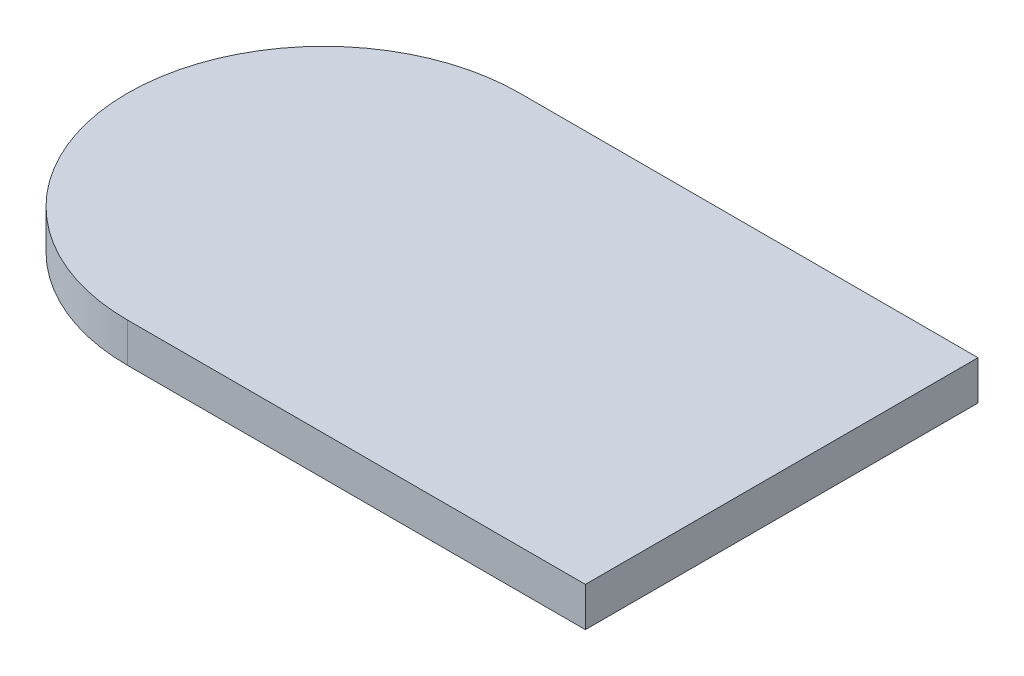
ISO-10303-21;
HEADER;
FILE_DESCRIPTION(('STEP AP214'),'2;1');
FILE_NAME('part.step','',(''),(''),'','','');
FILE_SCHEMA(('AUTOMOTIVE_DESIGN { 1 0 10303 214 1 1 1 1 }'));
ENDSEC;
DATA;
#1=APPLICATION_CONTEXT('core data for automotive mechanical design processes');
#2=APPLICATION_PROTOCOL_DEFINITION('international standard','automotive_design',2000,#1);
#3=PRODUCT_CONTEXT('',#1,'mechanical');
#4=PRODUCT('Part','Part','',(#3));
#5=PRODUCT_RELATED_PRODUCT_CATEGORY('part','',(#4));
#6=PRODUCT_DEFINITION_FORMATION('','',#4);
#7=PRODUCT_DEFINITION_CONTEXT('part definition',#1,'design');
#8=PRODUCT_DEFINITION('design','',#6,#7);
#9=PRODUCT_DEFINITION_SHAPE('','',#8);
#10=(LENGTH_UNIT() NAMED_UNIT(*) SI_UNIT(.MILLI.,.METRE.));
#11=(NAMED_UNIT(*) PLANE_ANGLE_UNIT() SI_UNIT($,.RADIAN.));
#12=(NAMED_UNIT(*) SI_UNIT($,.STERADIAN.) SOLID_ANGLE_UNIT());
#13=UNCERTAINTY_MEASURE_WITH_UNIT(LENGTH_MEASURE(1.E-05),#10,'distance_accuracy_value','');
#14=(GEOMETRIC_REPRESENTATION_CONTEXT(3) GLOBAL_UNCERTAINTY_ASSIGNED_CONTEXT((#13)) GLOBAL_UNIT_ASSIGNED_CONTEXT((#10,
#11,#12)) REPRESENTATION_CONTEXT('',''));
#15=CARTESIAN_POINT('',(0.,0.,0.));
#16=DIRECTION('',(0.,0.,1.));
#17=DIRECTION('',(1.,0.,0.));
#18=AXIS2_PLACEMENT_3D('',#15,#16,#17);
#19=CARTESIAN_POINT('',(0.,0.3,0.));
#20=DIRECTION('',(0.,-1.,0.));
#21=DIRECTION('',(0.,0.,-1.));
#22=AXIS2_PLACEMENT_3D('',#19,#20,#21);
#23=CYLINDRICAL_SURFACE('',#22,1.5);
#24=CARTESIAN_POINT('',(0.,0.,0.));
#25=DIRECTION('',(0.,1.,0.));
#26=DIRECTION('',(0.,0.,1.));
#27=AXIS2_PLACEMENT_3D('',#24,#25,#26);
#28=CIRCLE('',#27,1.5);
#29=CARTESIAN_POINT('',(0.,0.,-1.5));
#30=VERTEX_POINT('',#29);
#31=CARTESIAN_POINT('',(0.,0.,1.5));
#32=VERTEX_POINT('',#31);
#33=EDGE_CURVE('E95',#30,#32,#28,.T.);
#34=ORIENTED_EDGE('',*,*,#33,.T.);
#35=DIRECTION('',(0.,-1.,0.));
#36=VECTOR('',#35,1.);
#37=CARTESIAN_POINT('',(0.,0.3,1.5));
#38=LINE('',#37,#36);
#39=CARTESIAN_POINT('',(0.,0.3,1.5));
#40=VERTEX_POINT('',#39);
#41=EDGE_CURVE('E11',#40,#32,#38,.T.);
#42=ORIENTED_EDGE('',*,*,#41,.F.);
#43=CARTESIAN_POINT('',(0.,0.3,0.));
#44=DIRECTION('',(0.,1.,0.));
#45=DIRECTION('',(0.,0.,1.));
#46=AXIS2_PLACEMENT_3D('',#43,#44,#45);
#47=CIRCLE('',#46,1.5);
#48=CARTESIAN_POINT('',(0.,0.3,-1.5));
#49=VERTEX_POINT('',#48);
#50=EDGE_CURVE('E83',#49,#40,#47,.T.);
#51=ORIENTED_EDGE('',*,*,#50,.F.);
#52=DIRECTION('',(0.,-1.,0.));
#53=VECTOR('',#52,1.);
#54=CARTESIAN_POINT('',(0.,0.3,-1.5));
#55=LINE('',#54,#53);
#56=EDGE_CURVE('E91',#49,#30,#55,.T.);
#57=ORIENTED_EDGE('',*,*,#56,.T.);
#58=EDGE_LOOP('',(#34,#42,#51,#57));
#59=FACE_BOUND('',#58,.T.);
#60=ADVANCED_FACE('F32',(#59),#23,.T.);
#61=CARTESIAN_POINT('',(0.,0.3,1.5));
#62=DIRECTION('',(0.,0.,-1.));
#63=DIRECTION('',(-1.,0.,0.));
#64=AXIS2_PLACEMENT_3D('',#61,#62,#63);
#65=PLANE('',#64);
#66=DIRECTION('',(1.,0.,0.));
#67=VECTOR('',#66,1.);
#68=CARTESIAN_POINT('',(0.,0.,1.5));
#69=LINE('',#68,#67);
#70=CARTESIAN_POINT('',(3.5,0.,1.5));
#71=VERTEX_POINT('',#70);
#72=EDGE_CURVE('E87',#32,#71,#69,.T.);
#73=ORIENTED_EDGE('',*,*,#72,.T.);
#74=DIRECTION('',(0.,-1.,0.));
#75=VECTOR('',#74,1.);
#76=CARTESIAN_POINT('',(3.5,0.3,1.5));
#77=LINE('',#76,#75);
#78=CARTESIAN_POINT('',(3.5,0.3,1.5));
#79=VERTEX_POINT('',#78);
#80=EDGE_CURVE('E40',#79,#71,#77,.T.);
#81=ORIENTED_EDGE('',*,*,#80,.F.);
#82=DIRECTION('',(1.,0.,0.));
#83=VECTOR('',#82,1.);
#84=CARTESIAN_POINT('',(0.,0.3,1.5));
#85=LINE('',#84,#83);
#86=EDGE_CURVE('E78',#40,#79,#85,.T.);
#87=ORIENTED_EDGE('',*,*,#86,.F.);
#88=ORIENTED_EDGE('',*,*,#41,.T.);
#89=EDGE_LOOP('',(#73,#81,#87,#88));
#90=FACE_BOUND('',#89,.T.);
#91=ADVANCED_FACE('F86',(#90),#65,.F.);
#92=CARTESIAN_POINT('',(3.5,0.3,1.5));
#93=DIRECTION('',(-1.,0.,0.));
#94=DIRECTION('',(0.,0.,1.));
#95=AXIS2_PLACEMENT_3D('',#92,#93,#94);
#96=PLANE('',#95);
#97=DIRECTION('',(0.,0.,-1.));
#98=VECTOR('',#97,1.);
#99=CARTESIAN_POINT('',(3.5,0.,1.5));
#100=LINE('',#99,#98);
#101=CARTESIAN_POINT('',(3.5,0.,-1.5));
#102=VERTEX_POINT('',#101);
#103=EDGE_CURVE('E65',#71,#102,#100,.T.);
#104=ORIENTED_EDGE('',*,*,#103,.T.);
#105=DIRECTION('',(0.,-1.,0.));
#106=VECTOR('',#105,1.);
#107=CARTESIAN_POINT('',(3.5,0.3,-1.5));
#108=LINE('',#107,#106);
#109=CARTESIAN_POINT('',(3.5,0.3,-1.5));
#110=VERTEX_POINT('',#109);
#111=EDGE_CURVE('E88',#110,#102,#108,.T.);
#112=ORIENTED_EDGE('',*,*,#111,.F.);
#113=DIRECTION('',(0.,0.,-1.));
#114=VECTOR('',#113,1.);
#115=CARTESIAN_POINT('',(3.5,0.3,1.5));
#116=LINE('',#115,#114);
#117=EDGE_CURVE('E81',#79,#110,#116,.T.);
#118=ORIENTED_EDGE('',*,*,#117,.F.);
#119=ORIENTED_EDGE('',*,*,#80,.T.);
#120=EDGE_LOOP('',(#104,#112,#118,#119));
#121=FACE_BOUND('',#120,.T.);
#122=ADVANCED_FACE('F89',(#121),#96,.F.);
#123=CARTESIAN_POINT('',(0.,0.3,-1.5));
#124=DIRECTION('',(0.,0.,1.));
#125=DIRECTION('',(1.,0.,0.));
#126=AXIS2_PLACEMENT_3D('',#123,#124,#125);
#127=PLANE('',#126);
#128=DIRECTION('',(-1.,0.,0.));
#129=VECTOR('',#128,1.);
#130=CARTESIAN_POINT('',(0.,0.,-1.5));
#131=LINE('',#130,#129);
#132=EDGE_CURVE('E71',#102,#30,#131,.T.);
#133=ORIENTED_EDGE('',*,*,#132,.T.);
#134=ORIENTED_EDGE('',*,*,#56,.F.);
#135=DIRECTION('',(-1.,0.,0.));
#136=VECTOR('',#135,1.);
#137=CARTESIAN_POINT('',(0.,0.3,-1.5));
#138=LINE('',#137,#136);
#139=EDGE_CURVE('E48',#110,#49,#138,.T.);
#140=ORIENTED_EDGE('',*,*,#139,.F.);
#141=ORIENTED_EDGE('',*,*,#111,.T.);
#142=EDGE_LOOP('',(#133,#134,#140,#141));
#143=FACE_BOUND('',#142,.T.);
#144=ADVANCED_FACE('F102',(#143),#127,.F.);
#145=CARTESIAN_POINT('',(0.,0.3,0.));
#146=DIRECTION('',(0.,1.,0.));
#147=DIRECTION('',(0.,0.,1.));
#148=AXIS2_PLACEMENT_3D('',#145,#146,#147);
#149=PLANE('',#148);
#150=ORIENTED_EDGE('',*,*,#50,.T.);
#151=ORIENTED_EDGE('',*,*,#86,.T.);
#152=ORIENTED_EDGE('',*,*,#117,.T.);
#153=ORIENTED_EDGE('',*,*,#139,.T.);
#154=EDGE_LOOP('',(#150,#151,#152,#153));
#155=FACE_BOUND('',#154,.T.);
#156=ADVANCED_FACE('F79',(#155),#149,.T.);
#157=CARTESIAN_POINT('',(0.,0.,0.));
#158=DIRECTION('',(0.,1.,0.));
#159=DIRECTION('',(0.,0.,1.));
#160=AXIS2_PLACEMENT_3D('',#157,#158,#159);
#161=PLANE('',#160);
#162=ORIENTED_EDGE('',*,*,#33,.F.);
#163=ORIENTED_EDGE('',*,*,#132,.F.);
#164=ORIENTED_EDGE('',*,*,#103,.F.);
#165=ORIENTED_EDGE('',*,*,#72,.F.);
#166=EDGE_LOOP('',(#162,#163,#164,#165));
#167=FACE_BOUND('',#166,.T.);
#168=ADVANCED_FACE('F105',(#167),#161,.F.);
#169=CLOSED_SHELL('',(#60,#91,#122,#144,#156,#168));
#170=MANIFOLD_SOLID_BREP('B2',#169);
#171=ADVANCED_BREP_SHAPE_REPRESENTATION('',(#18,#170),#14);
#172=SHAPE_DEFINITION_REPRESENTATION(#9,#171);
ENDSEC;
END-ISO-10303-21;
